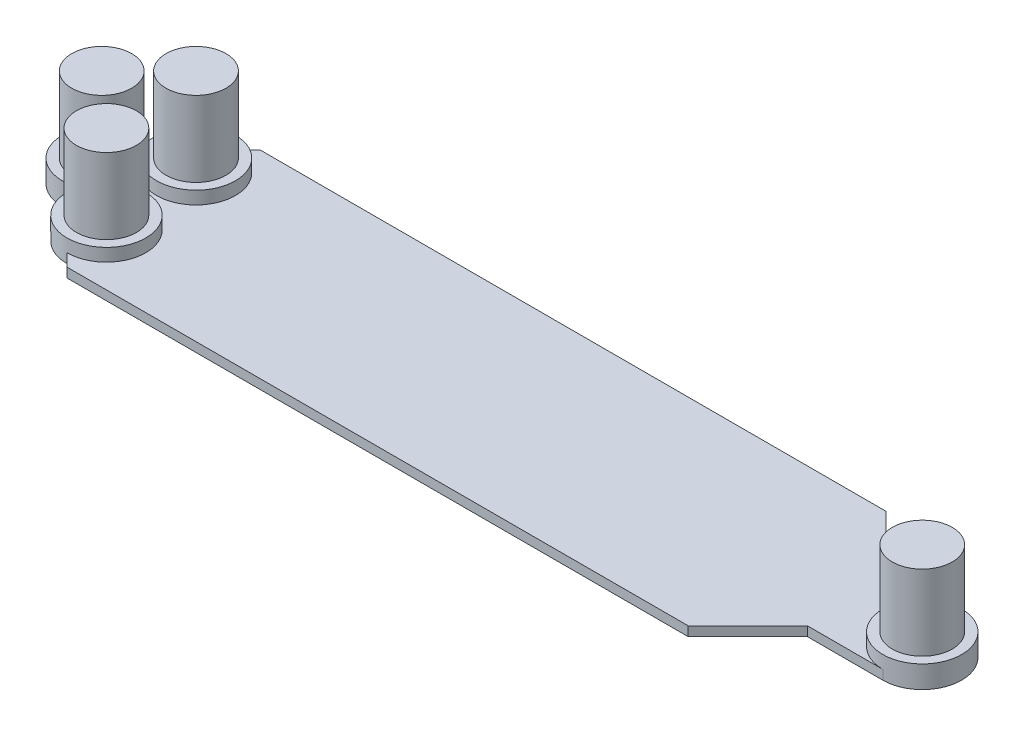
ISO-10303-21;
HEADER;
FILE_DESCRIPTION(('STEP AP214'),'2;1');
FILE_NAME('part.step','',(''),(''),'','','');
FILE_SCHEMA(('AUTOMOTIVE_DESIGN { 1 0 10303 214 1 1 1 1 }'));
ENDSEC;
DATA;
#1=APPLICATION_CONTEXT('core data for automotive mechanical design processes');
#2=APPLICATION_PROTOCOL_DEFINITION('international standard','automotive_design',2000,#1);
#3=PRODUCT_CONTEXT('',#1,'mechanical');
#4=PRODUCT('Part','Part','',(#3));
#5=PRODUCT_RELATED_PRODUCT_CATEGORY('part','',(#4));
#6=PRODUCT_DEFINITION_FORMATION('','',#4);
#7=PRODUCT_DEFINITION_CONTEXT('part definition',#1,'design');
#8=PRODUCT_DEFINITION('design','',#6,#7);
#9=PRODUCT_DEFINITION_SHAPE('','',#8);
#10=(LENGTH_UNIT() NAMED_UNIT(*) SI_UNIT(.MILLI.,.METRE.));
#11=(NAMED_UNIT(*) PLANE_ANGLE_UNIT() SI_UNIT($,.RADIAN.));
#12=(NAMED_UNIT(*) SI_UNIT($,.STERADIAN.) SOLID_ANGLE_UNIT());
#13=UNCERTAINTY_MEASURE_WITH_UNIT(LENGTH_MEASURE(1.E-05),#10,'distance_accuracy_value','');
#14=(GEOMETRIC_REPRESENTATION_CONTEXT(3) GLOBAL_UNCERTAINTY_ASSIGNED_CONTEXT((#13)) GLOBAL_UNIT_ASSIGNED_CONTEXT((#10,
#11,#12)) REPRESENTATION_CONTEXT('',''));
#15=CARTESIAN_POINT('',(0.,0.,0.));
#16=DIRECTION('',(0.,0.,1.));
#17=DIRECTION('',(1.,0.,0.));
#18=AXIS2_PLACEMENT_3D('',#15,#16,#17);
#19=CARTESIAN_POINT('',(44.5,2.36,0.));
#20=DIRECTION('',(0.,1.,0.));
#21=DIRECTION('',(0.,0.,1.));
#22=AXIS2_PLACEMENT_3D('',#19,#20,#21);
#23=PLANE('',#22);
#24=CARTESIAN_POINT('',(44.5,2.36,0.));
#25=DIRECTION('',(0.,1.,0.));
#26=DIRECTION('',(0.,0.,1.));
#27=AXIS2_PLACEMENT_3D('',#24,#25,#26);
#28=CIRCLE('',#27,4.18);
#29=CARTESIAN_POINT('',(44.5,2.36,4.18));
#30=VERTEX_POINT('',#29);
#31=EDGE_CURVE('E219',#30,#30,#28,.T.);
#32=ORIENTED_EDGE('',*,*,#31,.T.);
#33=EDGE_LOOP('',(#32));
#34=FACE_BOUND('',#33,.T.);
#35=CARTESIAN_POINT('',(44.4999999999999,2.36,0.));
#36=DIRECTION('',(0.,1.,0.));
#37=DIRECTION('',(0.,0.,1.));
#38=AXIS2_PLACEMENT_3D('',#35,#36,#37);
#39=CIRCLE('',#38,3.18);
#40=CARTESIAN_POINT('',(44.4999999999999,2.36,3.18));
#41=VERTEX_POINT('',#40);
#42=EDGE_CURVE('E510',#41,#41,#39,.T.);
#43=ORIENTED_EDGE('',*,*,#42,.F.);
#44=EDGE_LOOP('',(#43));
#45=FACE_BOUND('',#44,.T.);
#46=ADVANCED_FACE('F33',(#34,#45),#23,.T.);
#47=CARTESIAN_POINT('',(-37.,2.36,5.));
#48=DIRECTION('',(0.,1.,0.));
#49=DIRECTION('',(0.,0.,1.));
#50=AXIS2_PLACEMENT_3D('',#47,#48,#49);
#51=PLANE('',#50);
#52=CARTESIAN_POINT('',(-37.,2.36,5.));
#53=DIRECTION('',(0.,1.,0.));
#54=DIRECTION('',(0.,0.,1.));
#55=AXIS2_PLACEMENT_3D('',#52,#53,#54);
#56=CIRCLE('',#55,4.18);
#57=CARTESIAN_POINT('',(-37.,2.36,9.18));
#58=VERTEX_POINT('',#57);
#59=EDGE_CURVE('E225',#58,#58,#56,.T.);
#60=ORIENTED_EDGE('',*,*,#59,.T.);
#61=EDGE_LOOP('',(#60));
#62=FACE_BOUND('',#61,.T.);
#63=CARTESIAN_POINT('',(-37.0000000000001,2.36,5.));
#64=DIRECTION('',(0.,1.,0.));
#65=DIRECTION('',(0.,0.,1.));
#66=AXIS2_PLACEMENT_3D('',#63,#64,#65);
#67=CIRCLE('',#66,3.18);
#68=CARTESIAN_POINT('',(-37.0000000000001,2.36,8.18));
#69=VERTEX_POINT('',#68);
#70=EDGE_CURVE('E509',#69,#69,#67,.T.);
#71=ORIENTED_EDGE('',*,*,#70,.F.);
#72=EDGE_LOOP('',(#71));
#73=FACE_BOUND('',#72,.T.);
#74=ADVANCED_FACE('F459',(#62,#73),#51,.T.);
#75=CARTESIAN_POINT('',(-42.5,2.36,0.));
#76=DIRECTION('',(0.,1.,0.));
#77=DIRECTION('',(0.,0.,1.));
#78=AXIS2_PLACEMENT_3D('',#75,#76,#77);
#79=PLANE('',#78);
#80=CARTESIAN_POINT('',(-42.5000000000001,2.36,0.));
#81=DIRECTION('',(0.,1.,0.));
#82=DIRECTION('',(0.,0.,1.));
#83=AXIS2_PLACEMENT_3D('',#80,#81,#82);
#84=CIRCLE('',#83,3.18);
#85=CARTESIAN_POINT('',(-39.4514752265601,2.36,0.904929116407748));
#86=VERTEX_POINT('',#85);
#87=CARTESIAN_POINT('',(-39.3586662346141,2.36,-0.494390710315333));
#88=VERTEX_POINT('',#87);
#89=EDGE_CURVE('E207',#86,#88,#84,.T.);
#90=ORIENTED_EDGE('',*,*,#89,.F.);
#91=DIRECTION('',(0.547787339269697,0.,-0.8366176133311));
#92=VECTOR('',#91,1.);
#93=CARTESIAN_POINT('',(-41.519515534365,2.36,4.06337916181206));
#94=LINE('',#93,#92);
#95=CARTESIAN_POINT('',(-39.3182491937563,2.36,0.701457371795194));
#96=VERTEX_POINT('',#95);
#97=EDGE_CURVE('E183',#86,#96,#94,.T.);
#98=ORIENTED_EDGE('',*,*,#97,.T.);
#99=DIRECTION('',(0.,0.,-1.));
#100=VECTOR('',#99,1.);
#101=CARTESIAN_POINT('',(-39.3182491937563,2.36,0.701457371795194));
#102=LINE('',#101,#100);
#103=CARTESIAN_POINT('',(-39.3182491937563,2.36,-0.44348631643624));
#104=VERTEX_POINT('',#103);
#105=EDGE_CURVE('E182',#96,#104,#102,.T.);
#106=ORIENTED_EDGE('',*,*,#105,.T.);
#107=DIRECTION('',(-0.621815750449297,0.,-0.783163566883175));
#108=VECTOR('',#107,1.);
#109=CARTESIAN_POINT('',(-39.3182491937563,2.36,-0.44348631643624));
#110=LINE('',#109,#108);
#111=EDGE_CURVE('E239',#104,#88,#110,.T.);
#112=ORIENTED_EDGE('',*,*,#111,.T.);
#113=EDGE_LOOP('',(#90,#98,#106,#112));
#114=FACE_BOUND('',#113,.T.);
#115=ADVANCED_FACE('F441',(#114),#79,.T.);
#116=CARTESIAN_POINT('',(-37.5,2.36,-5.));
#117=DIRECTION('',(0.,1.,0.));
#118=DIRECTION('',(0.,0.,1.));
#119=AXIS2_PLACEMENT_3D('',#116,#117,#118);
#120=PLANE('',#119);
#121=CARTESIAN_POINT('',(-37.5000000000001,2.36,-5.));
#122=DIRECTION('',(0.,1.,0.));
#123=DIRECTION('',(0.,0.,1.));
#124=AXIS2_PLACEMENT_3D('',#121,#122,#123);
#125=CIRCLE('',#124,3.18);
#126=CARTESIAN_POINT('',(-37.5000000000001,2.36,-1.82));
#127=VERTEX_POINT('',#126);
#128=EDGE_CURVE('E194',#127,#127,#125,.T.);
#129=ORIENTED_EDGE('',*,*,#128,.F.);
#130=EDGE_LOOP('',(#129));
#131=FACE_BOUND('',#130,.T.);
#132=CARTESIAN_POINT('',(-37.5,2.36,-5.));
#133=DIRECTION('',(0.,1.,0.));
#134=DIRECTION('',(0.,0.,1.));
#135=AXIS2_PLACEMENT_3D('',#132,#133,#134);
#136=CIRCLE('',#135,4.18);
#137=CARTESIAN_POINT('',(-39.6533140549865,2.36,-1.41731405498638));
#138=VERTEX_POINT('',#137);
#139=CARTESIAN_POINT('',(-41.0826859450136,2.36,-2.84668594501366));
#140=VERTEX_POINT('',#139);
#141=EDGE_CURVE('E228',#138,#140,#136,.T.);
#142=ORIENTED_EDGE('',*,*,#141,.T.);
#143=EDGE_CURVE('E445',#138,#140,#84,.T.);
#144=ORIENTED_EDGE('',*,*,#143,.F.);
#145=EDGE_LOOP('',(#142,#144));
#146=FACE_BOUND('',#145,.T.);
#147=ADVANCED_FACE('F450',(#131,#146),#120,.T.);
#148=CARTESIAN_POINT('',(-42.5000000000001,1.,0.));
#149=DIRECTION('',(0.,1.,0.));
#150=DIRECTION('',(0.,0.,1.));
#151=AXIS2_PLACEMENT_3D('',#148,#149,#150);
#152=PLANE('',#151);
#153=DIRECTION('',(1.,0.,0.));
#154=VECTOR('',#153,1.);
#155=CARTESIAN_POINT('',(36.4999999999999,1.,4.18));
#156=LINE('',#155,#154);
#157=CARTESIAN_POINT('',(36.4999999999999,1.,4.18));
#158=VERTEX_POINT('',#157);
#159=CARTESIAN_POINT('',(44.4999999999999,1.,4.17999999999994));
#160=VERTEX_POINT('',#159);
#161=EDGE_CURVE('E386',#158,#160,#156,.T.);
#162=ORIENTED_EDGE('',*,*,#161,.T.);
#163=CARTESIAN_POINT('',(44.5,1.,0.));
#164=DIRECTION('',(0.,1.,0.));
#165=DIRECTION('',(0.,0.,1.));
#166=AXIS2_PLACEMENT_3D('',#163,#164,#165);
#167=CIRCLE('',#166,4.18);
#168=CARTESIAN_POINT('',(44.5000000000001,1.,-4.1799999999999));
#169=VERTEX_POINT('',#168);
#170=EDGE_CURVE('E216',#169,#160,#167,.T.);
#171=ORIENTED_EDGE('',*,*,#170,.F.);
#172=DIRECTION('',(-1.,0.,0.));
#173=VECTOR('',#172,1.);
#174=CARTESIAN_POINT('',(44.4999999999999,1.,-4.1799999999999));
#175=LINE('',#174,#173);
#176=CARTESIAN_POINT('',(36.4999999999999,1.,-4.18));
#177=VERTEX_POINT('',#176);
#178=EDGE_CURVE('E384',#169,#177,#175,.T.);
#179=ORIENTED_EDGE('',*,*,#178,.T.);
#180=DIRECTION('',(-0.707106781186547,0.,-0.707106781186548));
#181=VECTOR('',#180,1.);
#182=CARTESIAN_POINT('',(36.4999999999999,1.,-4.18));
#183=LINE('',#182,#181);
#184=CARTESIAN_POINT('',(30.1799999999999,1.,-10.5));
#185=VERTEX_POINT('',#184);
#186=EDGE_CURVE('E382',#177,#185,#183,.T.);
#187=ORIENTED_EDGE('',*,*,#186,.T.);
#188=DIRECTION('',(-1.,0.,0.));
#189=VECTOR('',#188,1.);
#190=CARTESIAN_POINT('',(30.1799999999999,1.,-10.5));
#191=LINE('',#190,#189);
#192=CARTESIAN_POINT('',(-36.1800000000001,1.,-10.5));
#193=VERTEX_POINT('',#192);
#194=EDGE_CURVE('E380',#185,#193,#191,.T.);
#195=ORIENTED_EDGE('',*,*,#194,.T.);
#196=DIRECTION('',(-0.707106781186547,0.,0.707106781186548));
#197=VECTOR('',#196,1.);
#198=CARTESIAN_POINT('',(-37.5000000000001,1.,-9.18));
#199=LINE('',#198,#197);
#200=CARTESIAN_POINT('',(-37.5000000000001,1.,-9.18));
#201=VERTEX_POINT('',#200);
#202=EDGE_CURVE('E286',#193,#201,#199,.T.);
#203=ORIENTED_EDGE('',*,*,#202,.T.);
#204=CARTESIAN_POINT('',(-37.5,1.,-5.));
#205=DIRECTION('',(0.,1.,0.));
#206=DIRECTION('',(0.,0.,1.));
#207=AXIS2_PLACEMENT_3D('',#204,#205,#206);
#208=CIRCLE('',#207,4.18);
#209=CARTESIAN_POINT('',(-41.6800000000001,1.,-5.));
#210=VERTEX_POINT('',#209);
#211=EDGE_CURVE('E11',#201,#210,#208,.F.);
#212=ORIENTED_EDGE('',*,*,#211,.T.);
#213=DIRECTION('',(-0.707106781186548,0.,0.707106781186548));
#214=VECTOR('',#213,1.);
#215=CARTESIAN_POINT('',(-42.5000000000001,1.,-4.18));
#216=LINE('',#215,#214);
#217=CARTESIAN_POINT('',(-42.5000000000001,1.,-4.18));
#218=VERTEX_POINT('',#217);
#219=EDGE_CURVE('E283',#210,#218,#216,.T.);
#220=ORIENTED_EDGE('',*,*,#219,.T.);
#221=CARTESIAN_POINT('',(-42.5,1.,0.));
#222=DIRECTION('',(0.,1.,0.));
#223=DIRECTION('',(0.,0.,1.));
#224=AXIS2_PLACEMENT_3D('',#221,#222,#223);
#225=CIRCLE('',#224,4.18);
#226=CARTESIAN_POINT('',(-42.2803801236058,1.,-4.17422652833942));
#227=VERTEX_POINT('',#226);
#228=EDGE_CURVE('E234',#227,#218,#225,.T.);
#229=ORIENTED_EDGE('',*,*,#228,.F.);
#230=DIRECTION('',(-0.621815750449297,0.,-0.783163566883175));
#231=VECTOR('',#230,1.);
#232=CARTESIAN_POINT('',(-39.3182491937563,1.,-0.44348631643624));
#233=LINE('',#232,#231);
#234=CARTESIAN_POINT('',(-39.3182491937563,1.,-0.44348631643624));
#235=VERTEX_POINT('',#234);
#236=EDGE_CURVE('E235',#235,#227,#233,.T.);
#237=ORIENTED_EDGE('',*,*,#236,.F.);
#238=DIRECTION('',(0.,0.,-1.));
#239=VECTOR('',#238,1.);
#240=CARTESIAN_POINT('',(-39.3182491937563,1.,0.701457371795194));
#241=LINE('',#240,#239);
#242=CARTESIAN_POINT('',(-39.3182491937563,1.,0.701457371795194));
#243=VERTEX_POINT('',#242);
#244=EDGE_CURVE('E244',#243,#235,#241,.T.);
#245=ORIENTED_EDGE('',*,*,#244,.F.);
#246=DIRECTION('',(0.547787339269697,0.,-0.8366176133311));
#247=VECTOR('',#246,1.);
#248=CARTESIAN_POINT('',(-41.519515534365,1.,4.06337916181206));
#249=LINE('',#248,#247);
#250=CARTESIAN_POINT('',(-41.519515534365,1.,4.06337916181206));
#251=VERTEX_POINT('',#250);
#252=EDGE_CURVE('E242',#251,#243,#249,.T.);
#253=ORIENTED_EDGE('',*,*,#252,.F.);
#254=CARTESIAN_POINT('',(-42.5,1.,4.18));
#255=VERTEX_POINT('',#254);
#256=EDGE_CURVE('E41',#255,#251,#225,.T.);
#257=ORIENTED_EDGE('',*,*,#256,.F.);
#258=DIRECTION('',(0.849441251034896,0.,0.527683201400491));
#259=VECTOR('',#258,1.);
#260=CARTESIAN_POINT('',(-41.1800000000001,1.,5.));
#261=LINE('',#260,#259);
#262=CARTESIAN_POINT('',(-41.1800000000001,1.,5.));
#263=VERTEX_POINT('',#262);
#264=EDGE_CURVE('E274',#255,#263,#261,.T.);
#265=ORIENTED_EDGE('',*,*,#264,.T.);
#266=CARTESIAN_POINT('',(-37.,1.,5.));
#267=DIRECTION('',(0.,1.,0.));
#268=DIRECTION('',(0.,0.,1.));
#269=AXIS2_PLACEMENT_3D('',#266,#267,#268);
#270=CIRCLE('',#269,4.18);
#271=CARTESIAN_POINT('',(-37.0000000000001,1.,9.18));
#272=VERTEX_POINT('',#271);
#273=EDGE_CURVE('E222',#272,#263,#270,.T.);
#274=ORIENTED_EDGE('',*,*,#273,.F.);
#275=DIRECTION('',(0.707106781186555,0.,0.70710678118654));
#276=VECTOR('',#275,1.);
#277=CARTESIAN_POINT('',(-37.0000000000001,1.,9.18));
#278=LINE('',#277,#276);
#279=CARTESIAN_POINT('',(-35.68,1.,10.5000000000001));
#280=VERTEX_POINT('',#279);
#281=EDGE_CURVE('E263',#272,#280,#278,.T.);
#282=ORIENTED_EDGE('',*,*,#281,.T.);
#283=DIRECTION('',(1.,0.,0.));
#284=VECTOR('',#283,1.);
#285=CARTESIAN_POINT('',(30.1799999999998,1.,10.5000000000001));
#286=LINE('',#285,#284);
#287=CARTESIAN_POINT('',(30.1799999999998,1.,10.5000000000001));
#288=VERTEX_POINT('',#287);
#289=EDGE_CURVE('E389',#280,#288,#286,.T.);
#290=ORIENTED_EDGE('',*,*,#289,.T.);
#291=DIRECTION('',(0.707106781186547,0.,-0.707106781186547));
#292=VECTOR('',#291,1.);
#293=CARTESIAN_POINT('',(36.4999999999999,1.,4.18));
#294=LINE('',#293,#292);
#295=EDGE_CURVE('E388',#288,#158,#294,.T.);
#296=ORIENTED_EDGE('',*,*,#295,.T.);
#297=EDGE_LOOP('',(#162,#171,#179,#187,#195,#203,#212,#220,#229,#237,#245,#253,#257,#265,#274,
#282,#290,#296));
#298=FACE_BOUND('',#297,.T.);
#299=ADVANCED_FACE('F394',(#298),#152,.T.);
#300=CARTESIAN_POINT('',(-42.5000000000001,1.,0.));
#301=DIRECTION('',(0.,-1.,0.));
#302=DIRECTION('',(0.,0.,-1.));
#303=AXIS2_PLACEMENT_3D('',#300,#301,#302);
#304=CYLINDRICAL_SURFACE('',#303,4.18);
#305=CARTESIAN_POINT('',(-42.5000000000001,0.,0.));
#306=DIRECTION('',(0.,1.,0.));
#307=DIRECTION('',(0.,0.,1.));
#308=AXIS2_PLACEMENT_3D('',#305,#306,#307);
#309=CIRCLE('',#308,4.18);
#310=CARTESIAN_POINT('',(-42.5000000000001,0.,-4.18));
#311=VERTEX_POINT('',#310);
#312=CARTESIAN_POINT('',(-42.5,0.,4.18));
#313=VERTEX_POINT('',#312);
#314=EDGE_CURVE('E259',#311,#313,#309,.T.);
#315=ORIENTED_EDGE('',*,*,#314,.T.);
#316=DIRECTION('',(0.,-1.,0.));
#317=VECTOR('',#316,1.);
#318=CARTESIAN_POINT('',(-42.5,1.,4.18));
#319=LINE('',#318,#317);
#320=EDGE_CURVE('E273',#255,#313,#319,.T.);
#321=ORIENTED_EDGE('',*,*,#320,.F.);
#322=ORIENTED_EDGE('',*,*,#256,.T.);
#323=DIRECTION('',(0.,-1.,0.));
#324=VECTOR('',#323,1.);
#325=CARTESIAN_POINT('',(-41.519515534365,2.36,4.06337916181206));
#326=LINE('',#325,#324);
#327=CARTESIAN_POINT('',(-41.519515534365,2.36,4.06337916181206));
#328=VERTEX_POINT('',#327);
#329=EDGE_CURVE('E257',#328,#251,#326,.T.);
#330=ORIENTED_EDGE('',*,*,#329,.F.);
#331=CARTESIAN_POINT('',(-42.5,2.36,0.));
#332=DIRECTION('',(0.,1.,0.));
#333=DIRECTION('',(0.,0.,1.));
#334=AXIS2_PLACEMENT_3D('',#331,#332,#333);
#335=CIRCLE('',#334,4.18);
#336=CARTESIAN_POINT('',(-42.2803801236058,2.36,-4.17422652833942));
#337=VERTEX_POINT('',#336);
#338=EDGE_CURVE('E178',#337,#328,#335,.T.);
#339=ORIENTED_EDGE('',*,*,#338,.F.);
#340=DIRECTION('',(0.,-1.,0.));
#341=VECTOR('',#340,1.);
#342=CARTESIAN_POINT('',(-42.2803801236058,2.36,-4.17422652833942));
#343=LINE('',#342,#341);
#344=EDGE_CURVE('E241',#337,#227,#343,.T.);
#345=ORIENTED_EDGE('',*,*,#344,.T.);
#346=ORIENTED_EDGE('',*,*,#228,.T.);
#347=DIRECTION('',(0.,-1.,0.));
#348=VECTOR('',#347,1.);
#349=CARTESIAN_POINT('',(-42.5000000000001,1.,-4.18));
#350=LINE('',#349,#348);
#351=EDGE_CURVE('E285',#218,#311,#350,.T.);
#352=ORIENTED_EDGE('',*,*,#351,.T.);
#353=EDGE_LOOP('',(#315,#321,#322,#330,#339,#345,#346,#352));
#354=FACE_BOUND('',#353,.T.);
#355=ADVANCED_FACE('F35',(#354),#304,.T.);
#356=CARTESIAN_POINT('',(-41.1800000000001,1.,5.));
#357=DIRECTION('',(0.527683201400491,0.,-0.849441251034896));
#358=DIRECTION('',(-0.849441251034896,0.,-0.527683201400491));
#359=AXIS2_PLACEMENT_3D('',#356,#357,#358);
#360=PLANE('',#359);
#361=DIRECTION('',(0.849441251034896,0.,0.527683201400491));
#362=VECTOR('',#361,1.);
#363=CARTESIAN_POINT('',(-41.1800000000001,0.,5.));
#364=LINE('',#363,#362);
#365=CARTESIAN_POINT('',(-41.1800000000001,0.,5.));
#366=VERTEX_POINT('',#365);
#367=EDGE_CURVE('E348',#313,#366,#364,.T.);
#368=ORIENTED_EDGE('',*,*,#367,.T.);
#369=DIRECTION('',(0.,-1.,0.));
#370=VECTOR('',#369,1.);
#371=CARTESIAN_POINT('',(-41.1800000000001,1.,5.));
#372=LINE('',#371,#370);
#373=EDGE_CURVE('E268',#263,#366,#372,.T.);
#374=ORIENTED_EDGE('',*,*,#373,.F.);
#375=ORIENTED_EDGE('',*,*,#264,.F.);
#376=ORIENTED_EDGE('',*,*,#320,.T.);
#377=EDGE_LOOP('',(#368,#374,#375,#376));
#378=FACE_BOUND('',#377,.T.);
#379=ADVANCED_FACE('F662',(#378),#360,.F.);
#380=CARTESIAN_POINT('',(-37.0000000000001,1.,4.99999999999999));
#381=DIRECTION('',(0.,-1.,0.));
#382=DIRECTION('',(0.,0.,-1.));
#383=AXIS2_PLACEMENT_3D('',#380,#381,#382);
#384=CYLINDRICAL_SURFACE('',#383,4.18000000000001);
#385=CARTESIAN_POINT('',(-37.0000000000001,0.,4.99999999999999));
#386=DIRECTION('',(0.,1.,0.));
#387=DIRECTION('',(0.,0.,1.));
#388=AXIS2_PLACEMENT_3D('',#385,#386,#387);
#389=CIRCLE('',#388,4.18000000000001);
#390=CARTESIAN_POINT('',(-37.0000000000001,0.,9.18));
#391=VERTEX_POINT('',#390);
#392=EDGE_CURVE('E342',#366,#391,#389,.T.);
#393=ORIENTED_EDGE('',*,*,#392,.T.);
#394=DIRECTION('',(0.,-1.,0.));
#395=VECTOR('',#394,1.);
#396=CARTESIAN_POINT('',(-37.0000000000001,1.,9.18));
#397=LINE('',#396,#395);
#398=EDGE_CURVE('E331',#272,#391,#397,.T.);
#399=ORIENTED_EDGE('',*,*,#398,.F.);
#400=ORIENTED_EDGE('',*,*,#273,.T.);
#401=ORIENTED_EDGE('',*,*,#373,.T.);
#402=EDGE_LOOP('',(#393,#399,#400,#401));
#403=FACE_BOUND('',#402,.T.);
#404=ORIENTED_EDGE('',*,*,#59,.F.);
#405=EDGE_LOOP('',(#404));
#406=FACE_BOUND('',#405,.T.);
#407=ADVANCED_FACE('F340',(#403,#406),#384,.T.);
#408=CARTESIAN_POINT('',(-37.0000000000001,1.,9.18));
#409=DIRECTION('',(0.70710678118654,0.,-0.707106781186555));
#410=DIRECTION('',(-0.707106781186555,0.,-0.70710678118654));
#411=AXIS2_PLACEMENT_3D('',#408,#409,#410);
#412=PLANE('',#411);
#413=DIRECTION('',(0.707106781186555,0.,0.70710678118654));
#414=VECTOR('',#413,1.);
#415=CARTESIAN_POINT('',(-37.0000000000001,0.,9.18));
#416=LINE('',#415,#414);
#417=CARTESIAN_POINT('',(-35.68,0.,10.5000000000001));
#418=VERTEX_POINT('',#417);
#419=EDGE_CURVE('E350',#391,#418,#416,.T.);
#420=ORIENTED_EDGE('',*,*,#419,.T.);
#421=DIRECTION('',(0.,-1.,0.));
#422=VECTOR('',#421,1.);
#423=CARTESIAN_POINT('',(-35.68,1.,10.5000000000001));
#424=LINE('',#423,#422);
#425=EDGE_CURVE('E329',#280,#418,#424,.T.);
#426=ORIENTED_EDGE('',*,*,#425,.F.);
#427=ORIENTED_EDGE('',*,*,#281,.F.);
#428=ORIENTED_EDGE('',*,*,#398,.T.);
#429=EDGE_LOOP('',(#420,#426,#427,#428));
#430=FACE_BOUND('',#429,.T.);
#431=ADVANCED_FACE('F395',(#430),#412,.F.);
#432=CARTESIAN_POINT('',(30.1799999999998,1.,10.5000000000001));
#433=DIRECTION('',(0.,0.,-1.));
#434=DIRECTION('',(-1.,0.,0.));
#435=AXIS2_PLACEMENT_3D('',#432,#433,#434);
#436=PLANE('',#435);
#437=DIRECTION('',(1.,0.,0.));
#438=VECTOR('',#437,1.);
#439=CARTESIAN_POINT('',(30.1799999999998,0.,10.5000000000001));
#440=LINE('',#439,#438);
#441=CARTESIAN_POINT('',(30.1799999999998,0.,10.5000000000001));
#442=VERTEX_POINT('',#441);
#443=EDGE_CURVE('E352',#418,#442,#440,.T.);
#444=ORIENTED_EDGE('',*,*,#443,.T.);
#445=DIRECTION('',(0.,-1.,0.));
#446=VECTOR('',#445,1.);
#447=CARTESIAN_POINT('',(30.1799999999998,1.,10.5000000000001));
#448=LINE('',#447,#446);
#449=EDGE_CURVE('E326',#288,#442,#448,.T.);
#450=ORIENTED_EDGE('',*,*,#449,.F.);
#451=ORIENTED_EDGE('',*,*,#289,.F.);
#452=ORIENTED_EDGE('',*,*,#425,.T.);
#453=EDGE_LOOP('',(#444,#450,#451,#452));
#454=FACE_BOUND('',#453,.T.);
#455=ADVANCED_FACE('F397',(#454),#436,.F.);
#456=CARTESIAN_POINT('',(36.4999999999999,1.,4.18));
#457=DIRECTION('',(-0.707106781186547,0.,-0.707106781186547));
#458=DIRECTION('',(-0.707106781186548,0.,0.707106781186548));
#459=AXIS2_PLACEMENT_3D('',#456,#457,#458);
#460=PLANE('',#459);
#461=DIRECTION('',(0.707106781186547,0.,-0.707106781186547));
#462=VECTOR('',#461,1.);
#463=CARTESIAN_POINT('',(36.4999999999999,0.,4.18));
#464=LINE('',#463,#462);
#465=CARTESIAN_POINT('',(36.4999999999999,0.,4.18));
#466=VERTEX_POINT('',#465);
#467=EDGE_CURVE('E358',#442,#466,#464,.T.);
#468=ORIENTED_EDGE('',*,*,#467,.T.);
#469=DIRECTION('',(0.,-1.,0.));
#470=VECTOR('',#469,1.);
#471=CARTESIAN_POINT('',(36.4999999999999,1.,4.18));
#472=LINE('',#471,#470);
#473=EDGE_CURVE('E323',#158,#466,#472,.T.);
#474=ORIENTED_EDGE('',*,*,#473,.F.);
#475=ORIENTED_EDGE('',*,*,#295,.F.);
#476=ORIENTED_EDGE('',*,*,#449,.T.);
#477=EDGE_LOOP('',(#468,#474,#475,#476));
#478=FACE_BOUND('',#477,.T.);
#479=ADVANCED_FACE('F402',(#478),#460,.F.);
#480=CARTESIAN_POINT('',(36.4999999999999,1.,4.18));
#481=DIRECTION('',(0.,0.,-1.));
#482=DIRECTION('',(-1.,0.,0.));
#483=AXIS2_PLACEMENT_3D('',#480,#481,#482);
#484=PLANE('',#483);
#485=DIRECTION('',(1.,0.,0.));
#486=VECTOR('',#485,1.);
#487=CARTESIAN_POINT('',(36.4999999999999,0.,4.18));
#488=LINE('',#487,#486);
#489=CARTESIAN_POINT('',(44.4999999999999,0.,4.17999999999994));
#490=VERTEX_POINT('',#489);
#491=EDGE_CURVE('E360',#466,#490,#488,.T.);
#492=ORIENTED_EDGE('',*,*,#491,.T.);
#493=DIRECTION('',(0.,-1.,0.));
#494=VECTOR('',#493,1.);
#495=CARTESIAN_POINT('',(44.4999999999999,1.,4.17999999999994));
#496=LINE('',#495,#494);
#497=EDGE_CURVE('E320',#160,#490,#496,.T.);
#498=ORIENTED_EDGE('',*,*,#497,.F.);
#499=ORIENTED_EDGE('',*,*,#161,.F.);
#500=ORIENTED_EDGE('',*,*,#473,.T.);
#501=EDGE_LOOP('',(#492,#498,#499,#500));
#502=FACE_BOUND('',#501,.T.);
#503=ADVANCED_FACE('F407',(#502),#484,.F.);
#504=CARTESIAN_POINT('',(44.4999999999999,1.,0.));
#505=DIRECTION('',(0.,-1.,0.));
#506=DIRECTION('',(0.,0.,-1.));
#507=AXIS2_PLACEMENT_3D('',#504,#505,#506);
#508=CYLINDRICAL_SURFACE('',#507,4.17999999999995);
#509=CARTESIAN_POINT('',(44.4999999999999,0.,0.));
#510=DIRECTION('',(0.,1.,0.));
#511=DIRECTION('',(0.,0.,-1.));
#512=AXIS2_PLACEMENT_3D('',#509,#510,#511);
#513=CIRCLE('',#512,4.17999999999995);
#514=CARTESIAN_POINT('',(44.4999999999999,0.,-4.1799999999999));
#515=VERTEX_POINT('',#514);
#516=EDGE_CURVE('E362',#490,#515,#513,.T.);
#517=ORIENTED_EDGE('',*,*,#516,.T.);
#518=DIRECTION('',(0.,-1.,0.));
#519=VECTOR('',#518,1.);
#520=CARTESIAN_POINT('',(44.4999999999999,1.,-4.1799999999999));
#521=LINE('',#520,#519);
#522=EDGE_CURVE('E317',#169,#515,#521,.T.);
#523=ORIENTED_EDGE('',*,*,#522,.F.);
#524=ORIENTED_EDGE('',*,*,#170,.T.);
#525=ORIENTED_EDGE('',*,*,#497,.T.);
#526=EDGE_LOOP('',(#517,#523,#524,#525));
#527=FACE_BOUND('',#526,.T.);
#528=ORIENTED_EDGE('',*,*,#31,.F.);
#529=EDGE_LOOP('',(#528));
#530=FACE_BOUND('',#529,.T.);
#531=ADVANCED_FACE('F412',(#527,#530),#508,.T.);
#532=CARTESIAN_POINT('',(44.4999999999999,1.,-4.1799999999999));
#533=DIRECTION('',(0.,0.,1.));
#534=DIRECTION('',(1.,0.,0.));
#535=AXIS2_PLACEMENT_3D('',#532,#533,#534);
#536=PLANE('',#535);
#537=DIRECTION('',(-1.,0.,0.));
#538=VECTOR('',#537,1.);
#539=CARTESIAN_POINT('',(44.4999999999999,0.,-4.1799999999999));
#540=LINE('',#539,#538);
#541=CARTESIAN_POINT('',(36.4999999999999,0.,-4.18));
#542=VERTEX_POINT('',#541);
#543=EDGE_CURVE('E364',#515,#542,#540,.T.);
#544=ORIENTED_EDGE('',*,*,#543,.T.);
#545=DIRECTION('',(0.,-1.,0.));
#546=VECTOR('',#545,1.);
#547=CARTESIAN_POINT('',(36.4999999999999,1.,-4.18));
#548=LINE('',#547,#546);
#549=EDGE_CURVE('E314',#177,#542,#548,.T.);
#550=ORIENTED_EDGE('',*,*,#549,.F.);
#551=ORIENTED_EDGE('',*,*,#178,.F.);
#552=ORIENTED_EDGE('',*,*,#522,.T.);
#553=EDGE_LOOP('',(#544,#550,#551,#552));
#554=FACE_BOUND('',#553,.T.);
#555=ADVANCED_FACE('F416',(#554),#536,.F.);
#556=CARTESIAN_POINT('',(36.4999999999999,1.,-4.18));
#557=DIRECTION('',(-0.707106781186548,0.,0.707106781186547));
#558=DIRECTION('',(0.707106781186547,0.,0.707106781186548));
#559=AXIS2_PLACEMENT_3D('',#556,#557,#558);
#560=PLANE('',#559);
#561=DIRECTION('',(-0.707106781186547,0.,-0.707106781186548));
#562=VECTOR('',#561,1.);
#563=CARTESIAN_POINT('',(36.4999999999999,0.,-4.18));
#564=LINE('',#563,#562);
#565=CARTESIAN_POINT('',(30.1799999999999,0.,-10.5));
#566=VERTEX_POINT('',#565);
#567=EDGE_CURVE('E366',#542,#566,#564,.T.);
#568=ORIENTED_EDGE('',*,*,#567,.T.);
#569=DIRECTION('',(0.,-1.,0.));
#570=VECTOR('',#569,1.);
#571=CARTESIAN_POINT('',(30.1799999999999,1.,-10.5));
#572=LINE('',#571,#570);
#573=EDGE_CURVE('E311',#185,#566,#572,.T.);
#574=ORIENTED_EDGE('',*,*,#573,.F.);
#575=ORIENTED_EDGE('',*,*,#186,.F.);
#576=ORIENTED_EDGE('',*,*,#549,.T.);
#577=EDGE_LOOP('',(#568,#574,#575,#576));
#578=FACE_BOUND('',#577,.T.);
#579=ADVANCED_FACE('F422',(#578),#560,.F.);
#580=CARTESIAN_POINT('',(30.1799999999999,1.,-10.5));
#581=DIRECTION('',(0.,0.,1.));
#582=DIRECTION('',(1.,0.,0.));
#583=AXIS2_PLACEMENT_3D('',#580,#581,#582);
#584=PLANE('',#583);
#585=DIRECTION('',(-1.,0.,0.));
#586=VECTOR('',#585,1.);
#587=CARTESIAN_POINT('',(30.1799999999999,0.,-10.5));
#588=LINE('',#587,#586);
#589=CARTESIAN_POINT('',(-36.1800000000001,0.,-10.5));
#590=VERTEX_POINT('',#589);
#591=EDGE_CURVE('E368',#566,#590,#588,.T.);
#592=ORIENTED_EDGE('',*,*,#591,.T.);
#593=DIRECTION('',(0.,-1.,0.));
#594=VECTOR('',#593,1.);
#595=CARTESIAN_POINT('',(-36.1800000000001,1.,-10.5));
#596=LINE('',#595,#594);
#597=EDGE_CURVE('E304',#193,#590,#596,.T.);
#598=ORIENTED_EDGE('',*,*,#597,.F.);
#599=ORIENTED_EDGE('',*,*,#194,.F.);
#600=ORIENTED_EDGE('',*,*,#573,.T.);
#601=EDGE_LOOP('',(#592,#598,#599,#600));
#602=FACE_BOUND('',#601,.T.);
#603=ADVANCED_FACE('F426',(#602),#584,.F.);
#604=CARTESIAN_POINT('',(-37.5000000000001,1.,-9.18));
#605=DIRECTION('',(0.707106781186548,0.,0.707106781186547));
#606=DIRECTION('',(0.707106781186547,0.,-0.707106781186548));
#607=AXIS2_PLACEMENT_3D('',#604,#605,#606);
#608=PLANE('',#607);
#609=DIRECTION('',(-0.707106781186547,0.,0.707106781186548));
#610=VECTOR('',#609,1.);
#611=CARTESIAN_POINT('',(-37.5000000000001,0.,-9.18));
#612=LINE('',#611,#610);
#613=CARTESIAN_POINT('',(-37.5000000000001,0.,-9.18));
#614=VERTEX_POINT('',#613);
#615=EDGE_CURVE('E370',#590,#614,#612,.T.);
#616=ORIENTED_EDGE('',*,*,#615,.T.);
#617=DIRECTION('',(0.,-1.,0.));
#618=VECTOR('',#617,1.);
#619=CARTESIAN_POINT('',(-37.5000000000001,1.,-9.18));
#620=LINE('',#619,#618);
#621=EDGE_CURVE('E297',#201,#614,#620,.T.);
#622=ORIENTED_EDGE('',*,*,#621,.F.);
#623=ORIENTED_EDGE('',*,*,#202,.F.);
#624=ORIENTED_EDGE('',*,*,#597,.T.);
#625=EDGE_LOOP('',(#616,#622,#623,#624));
#626=FACE_BOUND('',#625,.T.);
#627=ADVANCED_FACE('F431',(#626),#608,.F.);
#628=CARTESIAN_POINT('',(-37.5000000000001,1.,-5.));
#629=DIRECTION('',(0.,-1.,0.));
#630=DIRECTION('',(0.,0.,-1.));
#631=AXIS2_PLACEMENT_3D('',#628,#629,#630);
#632=CYLINDRICAL_SURFACE('',#631,4.18);
#633=CARTESIAN_POINT('',(-37.5000000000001,0.,-5.));
#634=DIRECTION('',(0.,1.,0.));
#635=DIRECTION('',(0.,0.,-1.));
#636=AXIS2_PLACEMENT_3D('',#633,#634,#635);
#637=CIRCLE('',#636,4.18);
#638=CARTESIAN_POINT('',(-41.6800000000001,0.,-5.));
#639=VERTEX_POINT('',#638);
#640=EDGE_CURVE('E371',#614,#639,#637,.T.);
#641=ORIENTED_EDGE('',*,*,#640,.T.);
#642=DIRECTION('',(0.,-1.,0.));
#643=VECTOR('',#642,1.);
#644=CARTESIAN_POINT('',(-41.6800000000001,1.,-5.));
#645=LINE('',#644,#643);
#646=EDGE_CURVE('E290',#210,#639,#645,.T.);
#647=ORIENTED_EDGE('',*,*,#646,.F.);
#648=ORIENTED_EDGE('',*,*,#211,.F.);
#649=ORIENTED_EDGE('',*,*,#621,.T.);
#650=EDGE_LOOP('',(#641,#647,#648,#649));
#651=FACE_BOUND('',#650,.T.);
#652=EDGE_CURVE('E231',#140,#138,#136,.T.);
#653=ORIENTED_EDGE('',*,*,#652,.F.);
#654=ORIENTED_EDGE('',*,*,#141,.F.);
#655=EDGE_LOOP('',(#653,#654));
#656=FACE_BOUND('',#655,.T.);
#657=ADVANCED_FACE('F432',(#651,#656),#632,.T.);
#658=CARTESIAN_POINT('',(-42.5000000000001,1.,-4.18));
#659=DIRECTION('',(0.707106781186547,0.,0.707106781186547));
#660=DIRECTION('',(0.707106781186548,0.,-0.707106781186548));
#661=AXIS2_PLACEMENT_3D('',#658,#659,#660);
#662=PLANE('',#661);
#663=DIRECTION('',(-0.707106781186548,0.,0.707106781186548));
#664=VECTOR('',#663,1.);
#665=CARTESIAN_POINT('',(-42.5000000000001,0.,-4.18));
#666=LINE('',#665,#664);
#667=EDGE_CURVE('E276',#639,#311,#666,.T.);
#668=ORIENTED_EDGE('',*,*,#667,.T.);
#669=ORIENTED_EDGE('',*,*,#351,.F.);
#670=ORIENTED_EDGE('',*,*,#219,.F.);
#671=ORIENTED_EDGE('',*,*,#646,.T.);
#672=EDGE_LOOP('',(#668,#669,#670,#671));
#673=FACE_BOUND('',#672,.T.);
#674=ADVANCED_FACE('F374',(#673),#662,.F.);
#675=CARTESIAN_POINT('',(-42.5000000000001,0.,0.));
#676=DIRECTION('',(0.,1.,0.));
#677=DIRECTION('',(0.,0.,1.));
#678=AXIS2_PLACEMENT_3D('',#675,#676,#677);
#679=PLANE('',#678);
#680=ORIENTED_EDGE('',*,*,#314,.F.);
#681=ORIENTED_EDGE('',*,*,#667,.F.);
#682=ORIENTED_EDGE('',*,*,#640,.F.);
#683=ORIENTED_EDGE('',*,*,#615,.F.);
#684=ORIENTED_EDGE('',*,*,#591,.F.);
#685=ORIENTED_EDGE('',*,*,#567,.F.);
#686=ORIENTED_EDGE('',*,*,#543,.F.);
#687=ORIENTED_EDGE('',*,*,#516,.F.);
#688=ORIENTED_EDGE('',*,*,#491,.F.);
#689=ORIENTED_EDGE('',*,*,#467,.F.);
#690=ORIENTED_EDGE('',*,*,#443,.F.);
#691=ORIENTED_EDGE('',*,*,#419,.F.);
#692=ORIENTED_EDGE('',*,*,#392,.F.);
#693=ORIENTED_EDGE('',*,*,#367,.F.);
#694=EDGE_LOOP('',(#680,#681,#682,#683,#684,#685,#686,#687,#688,#689,#690,#691,#692,#693));
#695=FACE_BOUND('',#694,.T.);
#696=ADVANCED_FACE('F347',(#695),#679,.F.);
#697=CARTESIAN_POINT('',(-41.519515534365,2.36,4.06337916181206));
#698=DIRECTION('',(-0.8366176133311,0.,-0.547787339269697));
#699=DIRECTION('',(-0.547787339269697,0.,0.8366176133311));
#700=AXIS2_PLACEMENT_3D('',#697,#698,#699);
#701=PLANE('',#700);
#702=ORIENTED_EDGE('',*,*,#252,.T.);
#703=DIRECTION('',(0.,-1.,0.));
#704=VECTOR('',#703,1.);
#705=CARTESIAN_POINT('',(-39.3182491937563,2.36,0.701457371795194));
#706=LINE('',#705,#704);
#707=EDGE_CURVE('E254',#96,#243,#706,.T.);
#708=ORIENTED_EDGE('',*,*,#707,.F.);
#709=ORIENTED_EDGE('',*,*,#97,.F.);
#710=CARTESIAN_POINT('',(-40.4515855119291,2.36,2.43236471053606));
#711=VERTEX_POINT('',#710);
#712=EDGE_CURVE('E185',#711,#86,#94,.T.);
#713=ORIENTED_EDGE('',*,*,#712,.F.);
#714=EDGE_CURVE('E174',#328,#711,#94,.T.);
#715=ORIENTED_EDGE('',*,*,#714,.F.);
#716=ORIENTED_EDGE('',*,*,#329,.T.);
#717=EDGE_LOOP('',(#702,#708,#709,#713,#715,#716));
#718=FACE_BOUND('',#717,.T.);
#719=ADVANCED_FACE('F189',(#718),#701,.F.);
#720=CARTESIAN_POINT('',(-39.3182491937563,2.36,0.701457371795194));
#721=DIRECTION('',(-1.,0.,0.));
#722=DIRECTION('',(0.,0.,1.));
#723=AXIS2_PLACEMENT_3D('',#720,#721,#722);
#724=PLANE('',#723);
#725=ORIENTED_EDGE('',*,*,#244,.T.);
#726=DIRECTION('',(0.,-1.,0.));
#727=VECTOR('',#726,1.);
#728=CARTESIAN_POINT('',(-39.3182491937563,2.36,-0.44348631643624));
#729=LINE('',#728,#727);
#730=EDGE_CURVE('E251',#104,#235,#729,.T.);
#731=ORIENTED_EDGE('',*,*,#730,.F.);
#732=ORIENTED_EDGE('',*,*,#105,.F.);
#733=ORIENTED_EDGE('',*,*,#707,.T.);
#734=EDGE_LOOP('',(#725,#731,#732,#733));
#735=FACE_BOUND('',#734,.T.);
#736=ADVANCED_FACE('F439',(#735),#724,.F.);
#737=CARTESIAN_POINT('',(-39.3182491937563,2.36,-0.44348631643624));
#738=DIRECTION('',(-0.783163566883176,0.,0.621815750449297));
#739=DIRECTION('',(0.621815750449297,0.,0.783163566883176));
#740=AXIS2_PLACEMENT_3D('',#737,#738,#739);
#741=PLANE('',#740);
#742=ORIENTED_EDGE('',*,*,#236,.T.);
#743=ORIENTED_EDGE('',*,*,#344,.F.);
#744=CARTESIAN_POINT('',(-41.3063697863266,2.36,-2.94748145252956));
#745=VERTEX_POINT('',#744);
#746=EDGE_CURVE('E238',#745,#337,#110,.T.);
#747=ORIENTED_EDGE('',*,*,#746,.F.);
#748=EDGE_CURVE('E55',#88,#745,#110,.T.);
#749=ORIENTED_EDGE('',*,*,#748,.F.);
#750=ORIENTED_EDGE('',*,*,#111,.F.);
#751=ORIENTED_EDGE('',*,*,#730,.T.);
#752=EDGE_LOOP('',(#742,#743,#747,#749,#750,#751));
#753=FACE_BOUND('',#752,.T.);
#754=ADVANCED_FACE('F435',(#753),#741,.F.);
#755=EDGE_CURVE('E48',#745,#711,#84,.T.);
#756=ORIENTED_EDGE('',*,*,#755,.F.);
#757=ORIENTED_EDGE('',*,*,#746,.T.);
#758=ORIENTED_EDGE('',*,*,#338,.T.);
#759=ORIENTED_EDGE('',*,*,#714,.T.);
#760=EDGE_LOOP('',(#756,#757,#758,#759));
#761=FACE_BOUND('',#760,.T.);
#762=ADVANCED_FACE('F176',(#761),#79,.T.);
#763=CARTESIAN_POINT('',(-37.5000000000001,10.36,-5.));
#764=DIRECTION('',(0.,-1.,0.));
#765=DIRECTION('',(0.,0.,-1.));
#766=AXIS2_PLACEMENT_3D('',#763,#764,#765);
#767=CYLINDRICAL_SURFACE('',#766,3.18);
#768=CARTESIAN_POINT('',(-37.5000000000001,10.36,-5.));
#769=DIRECTION('',(0.,1.,0.));
#770=DIRECTION('',(0.,0.,1.));
#771=AXIS2_PLACEMENT_3D('',#768,#769,#770);
#772=CIRCLE('',#771,3.18);
#773=CARTESIAN_POINT('',(-37.5000000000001,10.36,-1.82));
#774=VERTEX_POINT('',#773);
#775=EDGE_CURVE('E213',#774,#774,#772,.T.);
#776=ORIENTED_EDGE('',*,*,#775,.F.);
#777=EDGE_LOOP('',(#776));
#778=FACE_BOUND('',#777,.T.);
#779=ORIENTED_EDGE('',*,*,#128,.T.);
#780=EDGE_LOOP('',(#779));
#781=FACE_BOUND('',#780,.T.);
#782=ADVANCED_FACE('F472',(#778,#781),#767,.T.);
#783=CARTESIAN_POINT('',(-37.5000000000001,10.36,-5.));
#784=DIRECTION('',(0.,1.,0.));
#785=DIRECTION('',(0.,0.,1.));
#786=AXIS2_PLACEMENT_3D('',#783,#784,#785);
#787=PLANE('',#786);
#788=ORIENTED_EDGE('',*,*,#775,.T.);
#789=EDGE_LOOP('',(#788));
#790=FACE_BOUND('',#789,.T.);
#791=ADVANCED_FACE('F475',(#790),#787,.T.);
#792=CARTESIAN_POINT('',(-42.5000000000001,2.36,0.));
#793=DIRECTION('',(0.,1.,0.));
#794=DIRECTION('',(0.,0.,1.));
#795=AXIS2_PLACEMENT_3D('',#792,#793,#794);
#796=PLANE('',#795);
#797=EDGE_CURVE('E199',#711,#86,#84,.T.);
#798=ORIENTED_EDGE('',*,*,#797,.F.);
#799=ORIENTED_EDGE('',*,*,#712,.T.);
#800=EDGE_LOOP('',(#798,#799));
#801=FACE_BOUND('',#800,.T.);
#802=ADVANCED_FACE('F205',(#801),#796,.F.);
#803=EDGE_CURVE('E210',#88,#138,#84,.T.);
#804=ORIENTED_EDGE('',*,*,#803,.F.);
#805=ORIENTED_EDGE('',*,*,#748,.T.);
#806=EDGE_CURVE('E202',#140,#745,#84,.T.);
#807=ORIENTED_EDGE('',*,*,#806,.F.);
#808=ORIENTED_EDGE('',*,*,#652,.T.);
#809=EDGE_LOOP('',(#804,#805,#807,#808));
#810=FACE_BOUND('',#809,.T.);
#811=ADVANCED_FACE('F447',(#810),#796,.F.);
#812=CARTESIAN_POINT('',(-42.5000000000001,10.36,0.));
#813=DIRECTION('',(0.,-1.,0.));
#814=DIRECTION('',(0.,0.,-1.));
#815=AXIS2_PLACEMENT_3D('',#812,#813,#814);
#816=CYLINDRICAL_SURFACE('',#815,3.18);
#817=CARTESIAN_POINT('',(-42.5000000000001,10.36,0.));
#818=DIRECTION('',(0.,1.,0.));
#819=DIRECTION('',(0.,0.,1.));
#820=AXIS2_PLACEMENT_3D('',#817,#818,#819);
#821=CIRCLE('',#820,3.18);
#822=CARTESIAN_POINT('',(-42.5000000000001,10.36,3.18000000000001));
#823=VERTEX_POINT('',#822);
#824=EDGE_CURVE('E206',#823,#823,#821,.T.);
#825=ORIENTED_EDGE('',*,*,#824,.F.);
#826=EDGE_LOOP('',(#825));
#827=FACE_BOUND('',#826,.T.);
#828=ORIENTED_EDGE('',*,*,#797,.T.);
#829=ORIENTED_EDGE('',*,*,#89,.T.);
#830=ORIENTED_EDGE('',*,*,#803,.T.);
#831=ORIENTED_EDGE('',*,*,#143,.T.);
#832=ORIENTED_EDGE('',*,*,#806,.T.);
#833=ORIENTED_EDGE('',*,*,#755,.T.);
#834=EDGE_LOOP('',(#828,#829,#830,#831,#832,#833));
#835=FACE_BOUND('',#834,.T.);
#836=ADVANCED_FACE('F197',(#827,#835),#816,.T.);
#837=CARTESIAN_POINT('',(-42.5000000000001,10.36,0.));
#838=DIRECTION('',(0.,1.,0.));
#839=DIRECTION('',(0.,0.,1.));
#840=AXIS2_PLACEMENT_3D('',#837,#838,#839);
#841=PLANE('',#840);
#842=ORIENTED_EDGE('',*,*,#824,.T.);
#843=EDGE_LOOP('',(#842));
#844=FACE_BOUND('',#843,.T.);
#845=ADVANCED_FACE('F482',(#844),#841,.T.);
#846=CARTESIAN_POINT('',(-37.0000000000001,10.36,5.));
#847=DIRECTION('',(0.,-1.,0.));
#848=DIRECTION('',(0.,0.,-1.));
#849=AXIS2_PLACEMENT_3D('',#846,#847,#848);
#850=CYLINDRICAL_SURFACE('',#849,3.18);
#851=CARTESIAN_POINT('',(-37.0000000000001,10.36,5.));
#852=DIRECTION('',(0.,1.,0.));
#853=DIRECTION('',(0.,0.,1.));
#854=AXIS2_PLACEMENT_3D('',#851,#852,#853);
#855=CIRCLE('',#854,3.18);
#856=CARTESIAN_POINT('',(-37.0000000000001,10.36,8.18));
#857=VERTEX_POINT('',#856);
#858=EDGE_CURVE('E203',#857,#857,#855,.T.);
#859=ORIENTED_EDGE('',*,*,#858,.F.);
#860=EDGE_LOOP('',(#859));
#861=FACE_BOUND('',#860,.T.);
#862=ORIENTED_EDGE('',*,*,#70,.T.);
#863=EDGE_LOOP('',(#862));
#864=FACE_BOUND('',#863,.T.);
#865=ADVANCED_FACE('F488',(#861,#864),#850,.T.);
#866=CARTESIAN_POINT('',(-37.0000000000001,10.36,5.));
#867=DIRECTION('',(0.,1.,0.));
#868=DIRECTION('',(0.,0.,1.));
#869=AXIS2_PLACEMENT_3D('',#866,#867,#868);
#870=PLANE('',#869);
#871=ORIENTED_EDGE('',*,*,#858,.T.);
#872=EDGE_LOOP('',(#871));
#873=FACE_BOUND('',#872,.T.);
#874=ADVANCED_FACE('F492',(#873),#870,.T.);
#875=CARTESIAN_POINT('',(44.4999999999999,10.36,0.));
#876=DIRECTION('',(0.,-1.,0.));
#877=DIRECTION('',(0.,0.,-1.));
#878=AXIS2_PLACEMENT_3D('',#875,#876,#877);
#879=CYLINDRICAL_SURFACE('',#878,3.18);
#880=CARTESIAN_POINT('',(44.4999999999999,10.36,0.));
#881=DIRECTION('',(0.,1.,0.));
#882=DIRECTION('',(0.,0.,1.));
#883=AXIS2_PLACEMENT_3D('',#880,#881,#882);
#884=CIRCLE('',#883,3.18);
#885=CARTESIAN_POINT('',(44.4999999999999,10.36,3.18));
#886=VERTEX_POINT('',#885);
#887=EDGE_CURVE('E508',#886,#886,#884,.T.);
#888=ORIENTED_EDGE('',*,*,#887,.F.);
#889=EDGE_LOOP('',(#888));
#890=FACE_BOUND('',#889,.T.);
#891=ORIENTED_EDGE('',*,*,#42,.T.);
#892=EDGE_LOOP('',(#891));
#893=FACE_BOUND('',#892,.T.);
#894=ADVANCED_FACE('F496',(#890,#893),#879,.T.);
#895=CARTESIAN_POINT('',(44.4999999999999,10.36,0.));
#896=DIRECTION('',(0.,1.,0.));
#897=DIRECTION('',(0.,0.,1.));
#898=AXIS2_PLACEMENT_3D('',#895,#896,#897);
#899=PLANE('',#898);
#900=ORIENTED_EDGE('',*,*,#887,.T.);
#901=EDGE_LOOP('',(#900));
#902=FACE_BOUND('',#901,.T.);
#903=ADVANCED_FACE('F500',(#902),#899,.T.);
#904=CLOSED_SHELL('',(#46,#74,#115,#147,#299,#355,#379,#407,#431,#455,#479,#503,#531,#555,#579,
#603,#627,#657,#674,#696,#719,#736,#754,#762,#782,#791,#802,#811,#836,#845,#865,#874,#894,#903));
#905=MANIFOLD_SOLID_BREP('B2',#904);
#906=ADVANCED_BREP_SHAPE_REPRESENTATION('',(#18,#905),#14);
#907=SHAPE_DEFINITION_REPRESENTATION(#9,#906);
ENDSEC;
END-ISO-10303-21;
